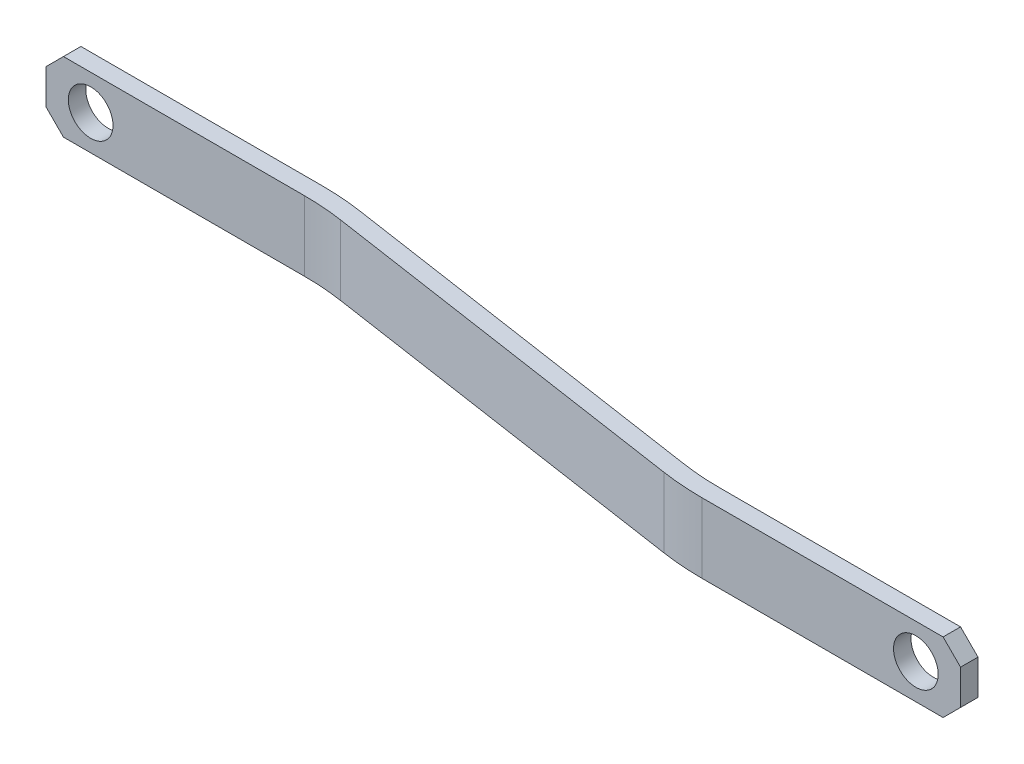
from build123d import *

# Parameters (mm, degrees)
SKETCH1_W          = 177.8
SKETCH1_H          = 12.7
BASE_EXTRUDE_DEPTH = 14.605
EXTRUDE1_DEPTH     = 50.8
SKETCH2_R          = 4.064
CUT_EXTRUDE1_DEPTH = 179.619077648
SKETCH3_R          = 4.064
CUT_EXTRUDE2_DEPTH = 187.071516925
CHAMFER1_SIZE      = 3.175
CHAMFER2_SIZE      = 3.175


with BuildPart() as part:
    # Sketch1 → Base-Extrude (new body)
    with BuildSketch(Plane.XY):
        with Locations((88.9, 6.35)):
            Rectangle(SKETCH1_W, SKETCH1_H)
    extrude(amount=BASE_EXTRUDE_DEPTH)


with BuildPart() as body_2:
    # Sketch5 → Extrude1 (new body)
    with BuildSketch(Plane(origin=(0, 12.7, 0), x_dir=(-1, 0, 0), z_dir=(0, 1, 0))):
        with BuildLine():
            Line((0, 0), (-47.022766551, 0))
            ThreePointArc((-47.022766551, 0), (-50.789601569, 0.139848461), (-54.535696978, 0.55862386))
            Line((-54.535696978, 0.55862386), (-123.733861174, 10.906290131))
            ThreePointArc((-123.733861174, 10.906290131), (-127.245825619, 11.298892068), (-130.777233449, 11.43))
            Line((-130.777233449, 11.43), (-177.8, 11.43))
            Line((-177.8, 11.43), (-177.8, 14.605))
            Line((-177.8, 14.605), (-130.777233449, 14.605))
            ThreePointArc((-130.777233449, 14.605), (-127.010398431, 14.465151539), (-123.264303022, 14.04637614))
            Line((-123.264303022, 14.04637614), (-54.066138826, 3.698709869))
            ThreePointArc((-54.066138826, 3.698709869), (-50.554174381, 3.306107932), (-47.022766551, 3.175))
            Line((-47.022766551, 3.175), (0, 3.175))
            Line((0, 3.175), (0, 0))
        make_face()
    extrude(amount=-EXTRUDE1_DEPTH)


with BuildPart() as part_1:
    add(part.part)

    # Combine1: intersect body 2
    add(body_2.part, mode=Mode.INTERSECT)

    # Sketch2 → Cut-Extrude1 (cut, through all)
    with BuildSketch(Plane.XY.offset(3.175)):
        with Locations((8.128, 6.35)):
            Circle(SKETCH2_R)
    extrude(amount=-CUT_EXTRUDE1_DEPTH, mode=Mode.SUBTRACT)

    # Sketch3 → Cut-Extrude2 (cut, through all)
    with BuildSketch(Plane(origin=(185.269572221, -0.228654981, 11.43), x_dir=(1, 0, 0), z_dir=(0, 0, 1))):
        with Locations((-15.597572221, 6.578654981)):
            Circle(SKETCH3_R)
    extrude(amount=CUT_EXTRUDE2_DEPTH, mode=Mode.SUBTRACT)

    # Chamfer1
    chamfer1_edges = [part_1.edges().sort_by_distance(p)[0] for p in [
        (177.8, 0, 13.0175),
        (177.8, 12.7, 13.0175),
    ]]
    chamfer(chamfer1_edges, length=CHAMFER1_SIZE)

    # Chamfer2
    chamfer2_edges = [part_1.edges().sort_by_distance(p)[0] for p in [
        (0, 12.7, 1.5875),
        (0, 0, 1.5875),
    ]]
    chamfer(chamfer2_edges, length=CHAMFER2_SIZE)


solid = part_1.part
